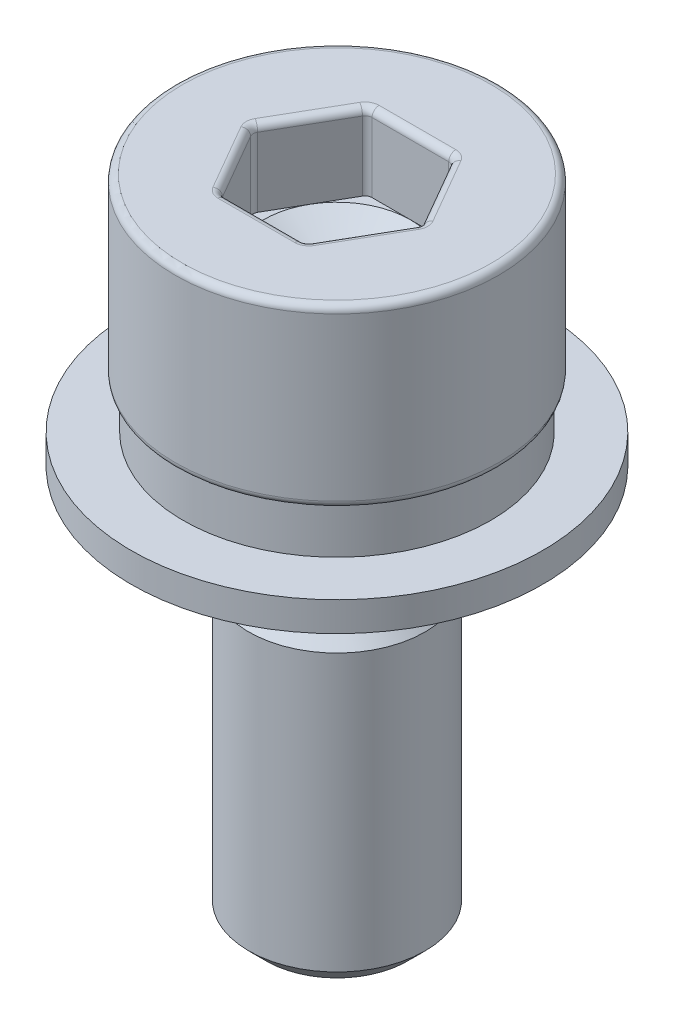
ISO-10303-21;
HEADER;
FILE_DESCRIPTION(('STEP AP214'),'2;1');
FILE_NAME('part.step','',(''),(''),'','','');
FILE_SCHEMA(('AUTOMOTIVE_DESIGN { 1 0 10303 214 1 1 1 1 }'));
ENDSEC;
DATA;
#1=APPLICATION_CONTEXT('core data for automotive mechanical design processes');
#2=APPLICATION_PROTOCOL_DEFINITION('international standard','automotive_design',2000,#1);
#3=PRODUCT_CONTEXT('',#1,'mechanical');
#4=PRODUCT('Part','Part','',(#3));
#5=PRODUCT_RELATED_PRODUCT_CATEGORY('part','',(#4));
#6=PRODUCT_DEFINITION_FORMATION('','',#4);
#7=PRODUCT_DEFINITION_CONTEXT('part definition',#1,'design');
#8=PRODUCT_DEFINITION('design','',#6,#7);
#9=PRODUCT_DEFINITION_SHAPE('','',#8);
#10=(LENGTH_UNIT() NAMED_UNIT(*) SI_UNIT(.MILLI.,.METRE.));
#11=(NAMED_UNIT(*) PLANE_ANGLE_UNIT() SI_UNIT($,.RADIAN.));
#12=(NAMED_UNIT(*) SI_UNIT($,.STERADIAN.) SOLID_ANGLE_UNIT());
#13=UNCERTAINTY_MEASURE_WITH_UNIT(LENGTH_MEASURE(1.E-05),#10,'distance_accuracy_value','');
#14=(GEOMETRIC_REPRESENTATION_CONTEXT(3) GLOBAL_UNCERTAINTY_ASSIGNED_CONTEXT((#13)) GLOBAL_UNIT_ASSIGNED_CONTEXT((#10,
#11,#12)) REPRESENTATION_CONTEXT('',''));
#15=CARTESIAN_POINT('',(0.,0.,0.));
#16=DIRECTION('',(0.,0.,1.));
#17=DIRECTION('',(1.,0.,0.));
#18=AXIS2_PLACEMENT_3D('',#15,#16,#17);
#19=CARTESIAN_POINT('',(0.,-1.30000000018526,0.));
#20=DIRECTION('',(0.,1.,0.));
#21=DIRECTION('',(-1.,0.,0.));
#22=AXIS2_PLACEMENT_3D('',#19,#20,#21);
#23=CONICAL_SURFACE('',#22,1.24999999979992,1.09083078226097);
#24=CARTESIAN_POINT('',(2.55795384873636E-10,-1.9507088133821,0.));
#25=VERTEX_POINT('',#24);
#26=VERTEX_LOOP('',#25);
#27=FACE_BOUND('',#26,.T.);
#28=CARTESIAN_POINT('',(0.,-1.3000000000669,0.));
#29=DIRECTION('',(0.,1.,0.));
#30=DIRECTION('',(-1.,0.,0.));
#31=AXIS2_PLACEMENT_3D('',#28,#29,#30);
#32=CIRCLE('',#31,1.25000000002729);
#33=CARTESIAN_POINT('',(1.08253175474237,-1.30000000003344,-0.625000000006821));
#34=VERTEX_POINT('',#33);
#35=CARTESIAN_POINT('',(1.08253175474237,-1.30000000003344,0.625000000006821));
#36=VERTEX_POINT('',#35);
#37=EDGE_CURVE('E149',#34,#36,#32,.F.);
#38=ORIENTED_EDGE('',*,*,#37,.F.);
#39=CARTESIAN_POINT('',(0.,-1.3000000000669,0.));
#40=DIRECTION('',(0.,1.,0.));
#41=DIRECTION('',(-1.,0.,0.));
#42=AXIS2_PLACEMENT_3D('',#39,#40,#41);
#43=CIRCLE('',#42,1.25000000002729);
#44=CARTESIAN_POINT('',(0.,-1.30000000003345,-1.25000000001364));
#45=VERTEX_POINT('',#44);
#46=EDGE_CURVE('E20',#45,#34,#43,.F.);
#47=ORIENTED_EDGE('',*,*,#46,.F.);
#48=CARTESIAN_POINT('',(0.,-1.3000000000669,0.));
#49=DIRECTION('',(0.,1.,0.));
#50=DIRECTION('',(-1.,0.,0.));
#51=AXIS2_PLACEMENT_3D('',#48,#49,#50);
#52=CIRCLE('',#51,1.25000000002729);
#53=CARTESIAN_POINT('',(-1.08253175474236,-1.30000000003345,-0.625000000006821));
#54=VERTEX_POINT('',#53);
#55=EDGE_CURVE('E278',#54,#45,#52,.F.);
#56=ORIENTED_EDGE('',*,*,#55,.F.);
#57=CARTESIAN_POINT('',(0.,-1.3000000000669,0.));
#58=DIRECTION('',(0.,1.,0.));
#59=DIRECTION('',(-1.,0.,0.));
#60=AXIS2_PLACEMENT_3D('',#57,#58,#59);
#61=CIRCLE('',#60,1.25000000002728);
#62=CARTESIAN_POINT('',(-1.08253175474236,-1.30000000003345,0.625000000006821));
#63=VERTEX_POINT('',#62);
#64=EDGE_CURVE('E275',#63,#54,#61,.F.);
#65=ORIENTED_EDGE('',*,*,#64,.F.);
#66=CARTESIAN_POINT('',(0.,-1.3000000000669,0.));
#67=DIRECTION('',(0.,1.,0.));
#68=DIRECTION('',(-1.,0.,0.));
#69=AXIS2_PLACEMENT_3D('',#66,#67,#68);
#70=CIRCLE('',#69,1.25000000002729);
#71=CARTESIAN_POINT('',(0.,-1.30000000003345,1.25000000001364));
#72=VERTEX_POINT('',#71);
#73=EDGE_CURVE('E280',#72,#63,#70,.F.);
#74=ORIENTED_EDGE('',*,*,#73,.F.);
#75=CARTESIAN_POINT('',(0.,-1.3000000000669,0.));
#76=DIRECTION('',(0.,1.,0.));
#77=DIRECTION('',(-1.,0.,0.));
#78=AXIS2_PLACEMENT_3D('',#75,#76,#77);
#79=CIRCLE('',#78,1.25000000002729);
#80=EDGE_CURVE('E154',#36,#72,#79,.F.);
#81=ORIENTED_EDGE('',*,*,#80,.F.);
#82=EDGE_LOOP('',(#38,#47,#56,#65,#74,#81));
#83=FACE_BOUND('',#82,.T.);
#84=ADVANCED_FACE('F16',(#27,#83),#23,.F.);
#85=CARTESIAN_POINT('',(0.,-1.3,0.));
#86=DIRECTION('',(0.,1.,0.));
#87=DIRECTION('',(-1.,0.,0.));
#88=AXIS2_PLACEMENT_3D('',#85,#86,#87);
#89=PLANE('',#88);
#90=DIRECTION('',(-0.5,0.,-0.866025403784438));
#91=VECTOR('',#90,1.);
#92=CARTESIAN_POINT('',(1.44337567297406,-1.30000000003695,0.));
#93=LINE('',#92,#91);
#94=CARTESIAN_POINT('',(0.756328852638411,-1.30000000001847,-1.19));
#95=VERTEX_POINT('',#94);
#96=EDGE_CURVE('E167',#34,#95,#93,.T.);
#97=ORIENTED_EDGE('',*,*,#96,.T.);
#98=CARTESIAN_POINT('',(0.652405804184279,-1.3,-1.13));
#99=DIRECTION('',(0.,-1.,0.));
#100=DIRECTION('',(1.,0.,0.));
#101=AXIS2_PLACEMENT_3D('',#98,#99,#100);
#102=CIRCLE('',#101,0.12);
#103=CARTESIAN_POINT('',(0.652405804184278,-1.3,-1.25));
#104=VERTEX_POINT('',#103);
#105=EDGE_CURVE('E272',#95,#104,#102,.F.);
#106=ORIENTED_EDGE('',*,*,#105,.T.);
#107=DIRECTION('',(-1.,0.,0.));
#108=VECTOR('',#107,1.);
#109=CARTESIAN_POINT('',(0.721687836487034,-1.3,-1.25));
#110=LINE('',#109,#108);
#111=EDGE_CURVE('E174',#104,#45,#110,.T.);
#112=ORIENTED_EDGE('',*,*,#111,.T.);
#113=ORIENTED_EDGE('',*,*,#46,.T.);
#114=EDGE_LOOP('',(#97,#106,#112,#113));
#115=FACE_BOUND('',#114,.T.);
#116=ADVANCED_FACE('F171',(#115),#89,.T.);
#117=CARTESIAN_POINT('',(0.,-1.3,0.));
#118=DIRECTION('',(0.,1.,0.));
#119=DIRECTION('',(-1.,0.,0.));
#120=AXIS2_PLACEMENT_3D('',#117,#118,#119);
#121=PLANE('',#120);
#122=CARTESIAN_POINT('',(1.30481160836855,-1.3,0.));
#123=DIRECTION('',(0.,-1.,0.));
#124=DIRECTION('',(1.,0.,0.));
#125=AXIS2_PLACEMENT_3D('',#122,#123,#124);
#126=CIRCLE('',#125,0.12);
#127=CARTESIAN_POINT('',(1.40873465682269,-1.30000000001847,0.06));
#128=VERTEX_POINT('',#127);
#129=CARTESIAN_POINT('',(1.40873465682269,-1.3,-0.06));
#130=VERTEX_POINT('',#129);
#131=EDGE_CURVE('E162',#128,#130,#126,.F.);
#132=ORIENTED_EDGE('',*,*,#131,.T.);
#133=DIRECTION('',(-0.5,0.,-0.866025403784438));
#134=VECTOR('',#133,1.);
#135=CARTESIAN_POINT('',(1.44337567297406,-1.3,0.));
#136=LINE('',#135,#134);
#137=EDGE_CURVE('E159',#130,#34,#136,.T.);
#138=ORIENTED_EDGE('',*,*,#137,.T.);
#139=ORIENTED_EDGE('',*,*,#37,.T.);
#140=DIRECTION('',(0.5,0.,-0.866025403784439));
#141=VECTOR('',#140,1.);
#142=CARTESIAN_POINT('',(0.721687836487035,-1.30000000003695,1.25));
#143=LINE('',#142,#141);
#144=EDGE_CURVE('E304',#36,#128,#143,.T.);
#145=ORIENTED_EDGE('',*,*,#144,.T.);
#146=EDGE_LOOP('',(#132,#138,#139,#145));
#147=FACE_BOUND('',#146,.T.);
#148=ADVANCED_FACE('F160',(#147),#121,.T.);
#149=CARTESIAN_POINT('',(0.,-1.3,0.));
#150=DIRECTION('',(0.,1.,0.));
#151=DIRECTION('',(-1.,0.,0.));
#152=AXIS2_PLACEMENT_3D('',#149,#150,#151);
#153=PLANE('',#152);
#154=DIRECTION('',(1.,0.,0.));
#155=VECTOR('',#154,1.);
#156=CARTESIAN_POINT('',(-0.721687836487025,-1.30000000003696,1.25));
#157=LINE('',#156,#155);
#158=CARTESIAN_POINT('',(0.65240580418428,-1.30000000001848,1.25));
#159=VERTEX_POINT('',#158);
#160=EDGE_CURVE('E286',#72,#159,#157,.T.);
#161=ORIENTED_EDGE('',*,*,#160,.T.);
#162=CARTESIAN_POINT('',(0.65240580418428,-1.3,1.13));
#163=DIRECTION('',(0.,-1.,0.));
#164=DIRECTION('',(1.,0.,0.));
#165=AXIS2_PLACEMENT_3D('',#162,#163,#164);
#166=CIRCLE('',#165,0.12);
#167=CARTESIAN_POINT('',(0.756328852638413,-1.3,1.19));
#168=VERTEX_POINT('',#167);
#169=EDGE_CURVE('E266',#159,#168,#166,.F.);
#170=ORIENTED_EDGE('',*,*,#169,.T.);
#171=DIRECTION('',(0.5,0.,-0.866025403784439));
#172=VECTOR('',#171,1.);
#173=CARTESIAN_POINT('',(0.721687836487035,-1.3,1.25));
#174=LINE('',#173,#172);
#175=EDGE_CURVE('E271',#168,#36,#174,.T.);
#176=ORIENTED_EDGE('',*,*,#175,.T.);
#177=ORIENTED_EDGE('',*,*,#80,.T.);
#178=EDGE_LOOP('',(#161,#170,#176,#177));
#179=FACE_BOUND('',#178,.T.);
#180=ADVANCED_FACE('F285',(#179),#153,.T.);
#181=CARTESIAN_POINT('',(0.,-1.3,0.));
#182=DIRECTION('',(0.,1.,0.));
#183=DIRECTION('',(-1.,0.,0.));
#184=AXIS2_PLACEMENT_3D('',#181,#182,#183);
#185=PLANE('',#184);
#186=DIRECTION('',(0.5,0.,0.866025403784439));
#187=VECTOR('',#186,1.);
#188=CARTESIAN_POINT('',(-1.44337567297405,-1.30000000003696,0.));
#189=LINE('',#188,#187);
#190=CARTESIAN_POINT('',(-0.756328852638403,-1.30000000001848,1.19));
#191=VERTEX_POINT('',#190);
#192=EDGE_CURVE('E364',#63,#191,#189,.T.);
#193=ORIENTED_EDGE('',*,*,#192,.T.);
#194=CARTESIAN_POINT('',(-0.65240580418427,-1.3,1.13));
#195=DIRECTION('',(0.,-1.,0.));
#196=DIRECTION('',(1.,0.,0.));
#197=AXIS2_PLACEMENT_3D('',#194,#195,#196);
#198=CIRCLE('',#197,0.12);
#199=CARTESIAN_POINT('',(-0.65240580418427,-1.3,1.25));
#200=VERTEX_POINT('',#199);
#201=EDGE_CURVE('E262',#191,#200,#198,.F.);
#202=ORIENTED_EDGE('',*,*,#201,.T.);
#203=DIRECTION('',(1.,0.,0.));
#204=VECTOR('',#203,1.);
#205=CARTESIAN_POINT('',(-0.721687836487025,-1.3,1.25));
#206=LINE('',#205,#204);
#207=EDGE_CURVE('E296',#200,#72,#206,.T.);
#208=ORIENTED_EDGE('',*,*,#207,.T.);
#209=ORIENTED_EDGE('',*,*,#73,.T.);
#210=EDGE_LOOP('',(#193,#202,#208,#209));
#211=FACE_BOUND('',#210,.T.);
#212=ADVANCED_FACE('F705',(#211),#185,.T.);
#213=CARTESIAN_POINT('',(0.,-1.3,0.));
#214=DIRECTION('',(0.,1.,0.));
#215=DIRECTION('',(-1.,0.,0.));
#216=AXIS2_PLACEMENT_3D('',#213,#214,#215);
#217=PLANE('',#216);
#218=DIRECTION('',(-1.,0.,0.));
#219=VECTOR('',#218,1.);
#220=CARTESIAN_POINT('',(0.721687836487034,-1.30000000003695,-1.25));
#221=LINE('',#220,#219);
#222=CARTESIAN_POINT('',(-0.65240580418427,-1.30000000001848,-1.25));
#223=VERTEX_POINT('',#222);
#224=EDGE_CURVE('E187',#45,#223,#221,.T.);
#225=ORIENTED_EDGE('',*,*,#224,.T.);
#226=CARTESIAN_POINT('',(-0.65240580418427,-1.3,-1.13));
#227=DIRECTION('',(0.,-1.,0.));
#228=DIRECTION('',(1.,0.,0.));
#229=AXIS2_PLACEMENT_3D('',#226,#227,#228);
#230=CIRCLE('',#229,0.12);
#231=CARTESIAN_POINT('',(-0.756328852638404,-1.3,-1.19));
#232=VERTEX_POINT('',#231);
#233=EDGE_CURVE('E188',#223,#232,#230,.F.);
#234=ORIENTED_EDGE('',*,*,#233,.T.);
#235=DIRECTION('',(-0.5,0.,0.866025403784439));
#236=VECTOR('',#235,1.);
#237=CARTESIAN_POINT('',(-0.721687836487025,-1.3,-1.25));
#238=LINE('',#237,#236);
#239=EDGE_CURVE('E358',#232,#54,#238,.T.);
#240=ORIENTED_EDGE('',*,*,#239,.T.);
#241=ORIENTED_EDGE('',*,*,#55,.T.);
#242=EDGE_LOOP('',(#225,#234,#240,#241));
#243=FACE_BOUND('',#242,.T.);
#244=ADVANCED_FACE('F701',(#243),#217,.T.);
#245=CARTESIAN_POINT('',(0.,-1.3,0.));
#246=DIRECTION('',(0.,1.,0.));
#247=DIRECTION('',(-1.,0.,0.));
#248=AXIS2_PLACEMENT_3D('',#245,#246,#247);
#249=PLANE('',#248);
#250=DIRECTION('',(-0.5,0.,0.866025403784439));
#251=VECTOR('',#250,1.);
#252=CARTESIAN_POINT('',(-0.721687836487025,-1.30000000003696,-1.25));
#253=LINE('',#252,#251);
#254=CARTESIAN_POINT('',(-1.40873465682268,-1.30000000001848,-0.06));
#255=VERTEX_POINT('',#254);
#256=EDGE_CURVE('E355',#54,#255,#253,.T.);
#257=ORIENTED_EDGE('',*,*,#256,.T.);
#258=CARTESIAN_POINT('',(-1.30481160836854,-1.3,0.));
#259=DIRECTION('',(0.,-1.,0.));
#260=DIRECTION('',(1.,0.,0.));
#261=AXIS2_PLACEMENT_3D('',#258,#259,#260);
#262=CIRCLE('',#261,0.12);
#263=CARTESIAN_POINT('',(-1.40873465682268,-1.3,0.06));
#264=VERTEX_POINT('',#263);
#265=EDGE_CURVE('E258',#255,#264,#262,.F.);
#266=ORIENTED_EDGE('',*,*,#265,.T.);
#267=DIRECTION('',(0.5,0.,0.866025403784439));
#268=VECTOR('',#267,1.);
#269=CARTESIAN_POINT('',(-1.44337567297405,-1.3,0.));
#270=LINE('',#269,#268);
#271=EDGE_CURVE('E362',#264,#63,#270,.T.);
#272=ORIENTED_EDGE('',*,*,#271,.T.);
#273=ORIENTED_EDGE('',*,*,#64,.T.);
#274=EDGE_LOOP('',(#257,#266,#272,#273));
#275=FACE_BOUND('',#274,.T.);
#276=ADVANCED_FACE('F697',(#275),#249,.T.);
#277=CARTESIAN_POINT('',(-0.65240580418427,-1.3,-1.13));
#278=DIRECTION('',(0.,-1.,0.));
#279=DIRECTION('',(1.,0.,0.));
#280=AXIS2_PLACEMENT_3D('',#277,#278,#279);
#281=CYLINDRICAL_SURFACE('',#280,0.12);
#282=CARTESIAN_POINT('',(-0.652405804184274,-0.120000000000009,-1.13));
#283=DIRECTION('',(0.,-1.,0.));
#284=DIRECTION('',(1.,0.,0.));
#285=AXIS2_PLACEMENT_3D('',#282,#283,#284);
#286=CIRCLE('',#285,0.12);
#287=CARTESIAN_POINT('',(-0.756328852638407,-0.12000000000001,-1.19));
#288=VERTEX_POINT('',#287);
#289=CARTESIAN_POINT('',(-0.652405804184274,-0.120000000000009,-1.25));
#290=VERTEX_POINT('',#289);
#291=EDGE_CURVE('E437',#288,#290,#286,.T.);
#292=ORIENTED_EDGE('',*,*,#291,.F.);
#293=DIRECTION('',(0.,1.,0.));
#294=VECTOR('',#293,1.);
#295=CARTESIAN_POINT('',(-0.756328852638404,-1.3,-1.19));
#296=LINE('',#295,#294);
#297=EDGE_CURVE('E361',#288,#232,#296,.F.);
#298=ORIENTED_EDGE('',*,*,#297,.T.);
#299=ORIENTED_EDGE('',*,*,#233,.F.);
#300=DIRECTION('',(0.,1.,0.));
#301=VECTOR('',#300,1.);
#302=CARTESIAN_POINT('',(-0.65240580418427,-1.3,-1.25));
#303=LINE('',#302,#301);
#304=EDGE_CURVE('E189',#223,#290,#303,.T.);
#305=ORIENTED_EDGE('',*,*,#304,.T.);
#306=EDGE_LOOP('',(#292,#298,#299,#305));
#307=FACE_BOUND('',#306,.T.);
#308=ADVANCED_FACE('F693',(#307),#281,.F.);
#309=CARTESIAN_POINT('',(0.721687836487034,-1.3,-1.25));
#310=DIRECTION('',(0.,0.,-1.));
#311=DIRECTION('',(-1.,0.,0.));
#312=AXIS2_PLACEMENT_3D('',#309,#310,#311);
#313=PLANE('',#312);
#314=ORIENTED_EDGE('',*,*,#224,.F.);
#315=ORIENTED_EDGE('',*,*,#111,.F.);
#316=DIRECTION('',(0.,-1.,0.));
#317=VECTOR('',#316,1.);
#318=CARTESIAN_POINT('',(0.652405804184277,-1.3,-1.25));
#319=LINE('',#318,#317);
#320=CARTESIAN_POINT('',(0.652405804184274,-0.120000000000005,-1.25));
#321=VERTEX_POINT('',#320);
#322=EDGE_CURVE('E168',#104,#321,#319,.F.);
#323=ORIENTED_EDGE('',*,*,#322,.T.);
#324=DIRECTION('',(1.,0.,0.));
#325=VECTOR('',#324,1.);
#326=CARTESIAN_POINT('',(0.72168783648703,-0.120000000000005,-1.25));
#327=LINE('',#326,#325);
#328=EDGE_CURVE('E345',#290,#321,#327,.T.);
#329=ORIENTED_EDGE('',*,*,#328,.F.);
#330=ORIENTED_EDGE('',*,*,#304,.F.);
#331=EDGE_LOOP('',(#314,#315,#323,#329,#330));
#332=FACE_BOUND('',#331,.T.);
#333=ADVANCED_FACE('F689',(#332),#313,.F.);
#334=CARTESIAN_POINT('',(0.652405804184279,-1.3,-1.13));
#335=DIRECTION('',(0.,-1.,0.));
#336=DIRECTION('',(1.,0.,0.));
#337=AXIS2_PLACEMENT_3D('',#334,#335,#336);
#338=CYLINDRICAL_SURFACE('',#337,0.12);
#339=CARTESIAN_POINT('',(0.652405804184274,-0.120000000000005,-1.13));
#340=DIRECTION('',(0.,-1.,0.));
#341=DIRECTION('',(1.,0.,0.));
#342=AXIS2_PLACEMENT_3D('',#339,#340,#341);
#343=CIRCLE('',#342,0.12);
#344=CARTESIAN_POINT('',(0.756328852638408,-0.120000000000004,-1.19));
#345=VERTEX_POINT('',#344);
#346=EDGE_CURVE('E335',#321,#345,#343,.T.);
#347=ORIENTED_EDGE('',*,*,#346,.F.);
#348=ORIENTED_EDGE('',*,*,#322,.F.);
#349=ORIENTED_EDGE('',*,*,#105,.F.);
#350=DIRECTION('',(0.,1.,0.));
#351=VECTOR('',#350,1.);
#352=CARTESIAN_POINT('',(0.756328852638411,-1.3,-1.19));
#353=LINE('',#352,#351);
#354=EDGE_CURVE('E180',#95,#345,#353,.T.);
#355=ORIENTED_EDGE('',*,*,#354,.T.);
#356=EDGE_LOOP('',(#347,#348,#349,#355));
#357=FACE_BOUND('',#356,.T.);
#358=ADVANCED_FACE('F686',(#357),#338,.F.);
#359=CARTESIAN_POINT('',(1.44337567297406,-1.3,0.));
#360=DIRECTION('',(0.866025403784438,0.,-0.5));
#361=DIRECTION('',(-0.5,0.,-0.866025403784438));
#362=AXIS2_PLACEMENT_3D('',#359,#360,#361);
#363=PLANE('',#362);
#364=DIRECTION('',(0.5,0.,0.866025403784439));
#365=VECTOR('',#364,1.);
#366=CARTESIAN_POINT('',(1.44337567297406,-0.120000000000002,0.));
#367=LINE('',#366,#365);
#368=CARTESIAN_POINT('',(1.40873465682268,-0.120000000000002,-0.06));
#369=VERTEX_POINT('',#368);
#370=EDGE_CURVE('E327',#345,#369,#367,.T.);
#371=ORIENTED_EDGE('',*,*,#370,.F.);
#372=ORIENTED_EDGE('',*,*,#354,.F.);
#373=ORIENTED_EDGE('',*,*,#96,.F.);
#374=ORIENTED_EDGE('',*,*,#137,.F.);
#375=DIRECTION('',(0.,-1.,0.));
#376=VECTOR('',#375,1.);
#377=CARTESIAN_POINT('',(1.40873465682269,-1.3,-0.06));
#378=LINE('',#377,#376);
#379=EDGE_CURVE('E182',#130,#369,#378,.F.);
#380=ORIENTED_EDGE('',*,*,#379,.T.);
#381=EDGE_LOOP('',(#371,#372,#373,#374,#380));
#382=FACE_BOUND('',#381,.T.);
#383=ADVANCED_FACE('F178',(#382),#363,.F.);
#384=CARTESIAN_POINT('',(1.30481160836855,-1.3,0.));
#385=DIRECTION('',(0.,-1.,0.));
#386=DIRECTION('',(1.,0.,0.));
#387=AXIS2_PLACEMENT_3D('',#384,#385,#386);
#388=CYLINDRICAL_SURFACE('',#387,0.12);
#389=CARTESIAN_POINT('',(1.30481160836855,-0.120000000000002,0.));
#390=DIRECTION('',(0.,-1.,0.));
#391=DIRECTION('',(1.,0.,0.));
#392=AXIS2_PLACEMENT_3D('',#389,#390,#391);
#393=CIRCLE('',#392,0.12);
#394=CARTESIAN_POINT('',(1.40873465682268,-0.120000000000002,0.0599999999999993));
#395=VERTEX_POINT('',#394);
#396=EDGE_CURVE('E318',#369,#395,#393,.T.);
#397=ORIENTED_EDGE('',*,*,#396,.F.);
#398=ORIENTED_EDGE('',*,*,#379,.F.);
#399=ORIENTED_EDGE('',*,*,#131,.F.);
#400=DIRECTION('',(0.,1.,0.));
#401=VECTOR('',#400,1.);
#402=CARTESIAN_POINT('',(1.40873465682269,-1.3,0.06));
#403=LINE('',#402,#401);
#404=EDGE_CURVE('E269',#128,#395,#403,.T.);
#405=ORIENTED_EDGE('',*,*,#404,.T.);
#406=EDGE_LOOP('',(#397,#398,#399,#405));
#407=FACE_BOUND('',#406,.T.);
#408=ADVANCED_FACE('F680',(#407),#388,.F.);
#409=CARTESIAN_POINT('',(0.721687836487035,-1.3,1.25));
#410=DIRECTION('',(0.866025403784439,0.,0.5));
#411=DIRECTION('',(0.5,0.,-0.866025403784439));
#412=AXIS2_PLACEMENT_3D('',#409,#410,#411);
#413=PLANE('',#412);
#414=DIRECTION('',(-0.5,0.,0.866025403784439));
#415=VECTOR('',#414,1.);
#416=CARTESIAN_POINT('',(0.721687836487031,-0.120000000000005,1.25));
#417=LINE('',#416,#415);
#418=CARTESIAN_POINT('',(0.756328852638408,-0.120000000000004,1.19));
#419=VERTEX_POINT('',#418);
#420=EDGE_CURVE('E407',#395,#419,#417,.T.);
#421=ORIENTED_EDGE('',*,*,#420,.F.);
#422=ORIENTED_EDGE('',*,*,#404,.F.);
#423=ORIENTED_EDGE('',*,*,#144,.F.);
#424=ORIENTED_EDGE('',*,*,#175,.F.);
#425=DIRECTION('',(0.,-1.,0.));
#426=VECTOR('',#425,1.);
#427=CARTESIAN_POINT('',(0.756328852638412,-1.3,1.19));
#428=LINE('',#427,#426);
#429=EDGE_CURVE('E268',#168,#419,#428,.F.);
#430=ORIENTED_EDGE('',*,*,#429,.T.);
#431=EDGE_LOOP('',(#421,#422,#423,#424,#430));
#432=FACE_BOUND('',#431,.T.);
#433=ADVANCED_FACE('F677',(#432),#413,.F.);
#434=CARTESIAN_POINT('',(0.65240580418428,-1.3,1.13));
#435=DIRECTION('',(0.,-1.,0.));
#436=DIRECTION('',(1.,0.,0.));
#437=AXIS2_PLACEMENT_3D('',#434,#435,#436);
#438=CYLINDRICAL_SURFACE('',#437,0.12);
#439=CARTESIAN_POINT('',(0.652405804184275,-0.120000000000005,1.13));
#440=DIRECTION('',(0.,-1.,0.));
#441=DIRECTION('',(1.,0.,0.));
#442=AXIS2_PLACEMENT_3D('',#439,#440,#441);
#443=CIRCLE('',#442,0.12);
#444=CARTESIAN_POINT('',(0.652405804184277,-0.120000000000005,1.25));
#445=VERTEX_POINT('',#444);
#446=EDGE_CURVE('E398',#419,#445,#443,.T.);
#447=ORIENTED_EDGE('',*,*,#446,.F.);
#448=ORIENTED_EDGE('',*,*,#429,.F.);
#449=ORIENTED_EDGE('',*,*,#169,.F.);
#450=DIRECTION('',(0.,1.,0.));
#451=VECTOR('',#450,1.);
#452=CARTESIAN_POINT('',(0.65240580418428,-1.3,1.25));
#453=LINE('',#452,#451);
#454=EDGE_CURVE('E265',#159,#445,#453,.T.);
#455=ORIENTED_EDGE('',*,*,#454,.T.);
#456=EDGE_LOOP('',(#447,#448,#449,#455));
#457=FACE_BOUND('',#456,.T.);
#458=ADVANCED_FACE('F674',(#457),#438,.F.);
#459=CARTESIAN_POINT('',(-0.721687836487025,-1.3,1.25));
#460=DIRECTION('',(0.,0.,1.));
#461=DIRECTION('',(1.,0.,0.));
#462=AXIS2_PLACEMENT_3D('',#459,#460,#461);
#463=PLANE('',#462);
#464=DIRECTION('',(-1.,0.,0.));
#465=VECTOR('',#464,1.);
#466=CARTESIAN_POINT('',(-0.721687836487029,-0.12000000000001,1.25));
#467=LINE('',#466,#465);
#468=CARTESIAN_POINT('',(-0.652405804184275,-0.120000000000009,1.25));
#469=VERTEX_POINT('',#468);
#470=EDGE_CURVE('E390',#445,#469,#467,.T.);
#471=ORIENTED_EDGE('',*,*,#470,.F.);
#472=ORIENTED_EDGE('',*,*,#454,.F.);
#473=ORIENTED_EDGE('',*,*,#160,.F.);
#474=ORIENTED_EDGE('',*,*,#207,.F.);
#475=DIRECTION('',(0.,-1.,0.));
#476=VECTOR('',#475,1.);
#477=CARTESIAN_POINT('',(-0.65240580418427,-1.3,1.25));
#478=LINE('',#477,#476);
#479=EDGE_CURVE('E264',#200,#469,#478,.F.);
#480=ORIENTED_EDGE('',*,*,#479,.T.);
#481=EDGE_LOOP('',(#471,#472,#473,#474,#480));
#482=FACE_BOUND('',#481,.T.);
#483=ADVANCED_FACE('F293',(#482),#463,.F.);
#484=CARTESIAN_POINT('',(-0.65240580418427,-1.3,1.13));
#485=DIRECTION('',(0.,-1.,0.));
#486=DIRECTION('',(1.,0.,0.));
#487=AXIS2_PLACEMENT_3D('',#484,#485,#486);
#488=CYLINDRICAL_SURFACE('',#487,0.12);
#489=CARTESIAN_POINT('',(-0.652405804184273,-0.12000000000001,1.13));
#490=DIRECTION('',(0.,-1.,0.));
#491=DIRECTION('',(1.,0.,0.));
#492=AXIS2_PLACEMENT_3D('',#489,#490,#491);
#493=CIRCLE('',#492,0.12);
#494=CARTESIAN_POINT('',(-0.756328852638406,-0.12000000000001,1.19));
#495=VERTEX_POINT('',#494);
#496=EDGE_CURVE('E381',#469,#495,#493,.T.);
#497=ORIENTED_EDGE('',*,*,#496,.F.);
#498=ORIENTED_EDGE('',*,*,#479,.F.);
#499=ORIENTED_EDGE('',*,*,#201,.F.);
#500=DIRECTION('',(0.,1.,0.));
#501=VECTOR('',#500,1.);
#502=CARTESIAN_POINT('',(-0.756328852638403,-1.3,1.19));
#503=LINE('',#502,#501);
#504=EDGE_CURVE('E261',#191,#495,#503,.T.);
#505=ORIENTED_EDGE('',*,*,#504,.T.);
#506=EDGE_LOOP('',(#497,#498,#499,#505));
#507=FACE_BOUND('',#506,.T.);
#508=ADVANCED_FACE('F521',(#507),#488,.F.);
#509=CARTESIAN_POINT('',(-1.44337567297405,-1.3,0.));
#510=DIRECTION('',(-0.866025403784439,0.,0.5));
#511=DIRECTION('',(0.5,0.,0.866025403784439));
#512=AXIS2_PLACEMENT_3D('',#509,#510,#511);
#513=PLANE('',#512);
#514=DIRECTION('',(-0.5,0.,-0.866025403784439));
#515=VECTOR('',#514,1.);
#516=CARTESIAN_POINT('',(-1.44337567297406,-0.120000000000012,0.));
#517=LINE('',#516,#515);
#518=CARTESIAN_POINT('',(-1.40873465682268,-0.120000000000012,0.06));
#519=VERTEX_POINT('',#518);
#520=EDGE_CURVE('E464',#495,#519,#517,.T.);
#521=ORIENTED_EDGE('',*,*,#520,.F.);
#522=ORIENTED_EDGE('',*,*,#504,.F.);
#523=ORIENTED_EDGE('',*,*,#192,.F.);
#524=ORIENTED_EDGE('',*,*,#271,.F.);
#525=DIRECTION('',(0.,-1.,0.));
#526=VECTOR('',#525,1.);
#527=CARTESIAN_POINT('',(-1.40873465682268,-1.3,0.06));
#528=LINE('',#527,#526);
#529=EDGE_CURVE('E260',#264,#519,#528,.F.);
#530=ORIENTED_EDGE('',*,*,#529,.T.);
#531=EDGE_LOOP('',(#521,#522,#523,#524,#530));
#532=FACE_BOUND('',#531,.T.);
#533=ADVANCED_FACE('F474',(#532),#513,.F.);
#534=CARTESIAN_POINT('',(-1.30481160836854,-1.3,0.));
#535=DIRECTION('',(0.,-1.,0.));
#536=DIRECTION('',(1.,0.,0.));
#537=AXIS2_PLACEMENT_3D('',#534,#535,#536);
#538=CYLINDRICAL_SURFACE('',#537,0.12);
#539=CARTESIAN_POINT('',(-1.30481160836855,-0.120000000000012,0.));
#540=DIRECTION('',(0.,-1.,0.));
#541=DIRECTION('',(0.,0.,-1.));
#542=AXIS2_PLACEMENT_3D('',#539,#540,#541);
#543=CIRCLE('',#542,0.120000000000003);
#544=CARTESIAN_POINT('',(-1.40873465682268,-0.120000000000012,-0.06));
#545=VERTEX_POINT('',#544);
#546=EDGE_CURVE('E458',#519,#545,#543,.T.);
#547=ORIENTED_EDGE('',*,*,#546,.F.);
#548=ORIENTED_EDGE('',*,*,#529,.F.);
#549=ORIENTED_EDGE('',*,*,#265,.F.);
#550=DIRECTION('',(0.,1.,0.));
#551=VECTOR('',#550,1.);
#552=CARTESIAN_POINT('',(-1.40873465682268,-1.3,-0.06));
#553=LINE('',#552,#551);
#554=EDGE_CURVE('E357',#255,#545,#553,.T.);
#555=ORIENTED_EDGE('',*,*,#554,.T.);
#556=EDGE_LOOP('',(#547,#548,#549,#555));
#557=FACE_BOUND('',#556,.T.);
#558=ADVANCED_FACE('F664',(#557),#538,.F.);
#559=CARTESIAN_POINT('',(-0.721687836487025,-1.3,-1.25));
#560=DIRECTION('',(-0.866025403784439,0.,-0.5));
#561=DIRECTION('',(-0.5,0.,0.866025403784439));
#562=AXIS2_PLACEMENT_3D('',#559,#560,#561);
#563=PLANE('',#562);
#564=ORIENTED_EDGE('',*,*,#256,.F.);
#565=ORIENTED_EDGE('',*,*,#239,.F.);
#566=ORIENTED_EDGE('',*,*,#297,.F.);
#567=DIRECTION('',(0.5,0.,-0.866025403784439));
#568=VECTOR('',#567,1.);
#569=CARTESIAN_POINT('',(-0.72168783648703,-0.120000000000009,-1.25));
#570=LINE('',#569,#568);
#571=EDGE_CURVE('E444',#545,#288,#570,.T.);
#572=ORIENTED_EDGE('',*,*,#571,.F.);
#573=ORIENTED_EDGE('',*,*,#554,.F.);
#574=EDGE_LOOP('',(#564,#565,#566,#572,#573));
#575=FACE_BOUND('',#574,.T.);
#576=ADVANCED_FACE('F660',(#575),#563,.F.);
#577=CARTESIAN_POINT('',(1.5,-11.,0.));
#578=DIRECTION('',(0.,-1.,0.));
#579=DIRECTION('',(1.,0.,0.));
#580=AXIS2_PLACEMENT_3D('',#577,#578,#579);
#581=PLANE('',#580);
#582=CARTESIAN_POINT('',(0.,-10.9999999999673,0.));
#583=DIRECTION('',(0.,1.,0.));
#584=DIRECTION('',(-1.,0.,0.));
#585=AXIS2_PLACEMENT_3D('',#582,#583,#584);
#586=CIRCLE('',#585,1.20000000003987);
#587=CARTESIAN_POINT('',(-1.20000000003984,-10.9999999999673,0.));
#588=VERTEX_POINT('',#587);
#589=EDGE_CURVE('E254',#588,#588,#586,.T.);
#590=ORIENTED_EDGE('',*,*,#589,.F.);
#591=EDGE_LOOP('',(#590));
#592=FACE_BOUND('',#591,.T.);
#593=ADVANCED_FACE('F657',(#592),#581,.T.);
#594=CARTESIAN_POINT('',(-0.652405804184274,-0.120000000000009,-1.13));
#595=DIRECTION('',(0.,1.,0.));
#596=DIRECTION('',(-1.,0.,0.));
#597=AXIS2_PLACEMENT_3D('',#594,#595,#596);
#598=TOROIDAL_SURFACE('',#597,0.24,0.12);
#599=CARTESIAN_POINT('',(-0.652405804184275,-0.120000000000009,-1.37));
#600=DIRECTION('',(1.,0.,0.));
#601=DIRECTION('',(0.,1.,0.));
#602=AXIS2_PLACEMENT_3D('',#599,#600,#601);
#603=CIRCLE('',#602,0.12);
#604=CARTESIAN_POINT('',(-0.652405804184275,0.,-1.37));
#605=VERTEX_POINT('',#604);
#606=EDGE_CURVE('E348',#605,#290,#603,.T.);
#607=ORIENTED_EDGE('',*,*,#606,.F.);
#608=CARTESIAN_POINT('',(-0.652405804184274,0.,-1.13));
#609=DIRECTION('',(0.,1.,0.));
#610=DIRECTION('',(-1.,0.,0.));
#611=AXIS2_PLACEMENT_3D('',#608,#609,#610);
#612=CIRCLE('',#611,0.24);
#613=CARTESIAN_POINT('',(-0.86025190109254,0.,-1.25));
#614=VERTEX_POINT('',#613);
#615=EDGE_CURVE('E251',#614,#605,#612,.F.);
#616=ORIENTED_EDGE('',*,*,#615,.F.);
#617=CARTESIAN_POINT('',(-0.86025190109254,-0.12000000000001,-1.25));
#618=DIRECTION('',(0.5,0.,-0.866025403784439));
#619=DIRECTION('',(-0.866025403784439,0.,-0.5));
#620=AXIS2_PLACEMENT_3D('',#617,#618,#619);
#621=CIRCLE('',#620,0.12);
#622=EDGE_CURVE('E257',#288,#614,#621,.F.);
#623=ORIENTED_EDGE('',*,*,#622,.F.);
#624=ORIENTED_EDGE('',*,*,#291,.T.);
#625=EDGE_LOOP('',(#607,#616,#623,#624));
#626=FACE_BOUND('',#625,.T.);
#627=ADVANCED_FACE('F655',(#626),#598,.T.);
#628=CARTESIAN_POINT('',(0.72168783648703,-0.120000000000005,-1.37));
#629=DIRECTION('',(1.,0.,0.));
#630=DIRECTION('',(0.,1.,0.));
#631=AXIS2_PLACEMENT_3D('',#628,#629,#630);
#632=CYLINDRICAL_SURFACE('',#631,0.12);
#633=CARTESIAN_POINT('',(0.652405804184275,-0.120000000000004,-1.37));
#634=DIRECTION('',(1.,0.,0.));
#635=DIRECTION('',(0.,1.,0.));
#636=AXIS2_PLACEMENT_3D('',#633,#634,#635);
#637=CIRCLE('',#636,0.12);
#638=CARTESIAN_POINT('',(0.652405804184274,0.,-1.37));
#639=VERTEX_POINT('',#638);
#640=EDGE_CURVE('E338',#639,#321,#637,.T.);
#641=ORIENTED_EDGE('',*,*,#640,.F.);
#642=DIRECTION('',(-1.,0.,0.));
#643=VECTOR('',#642,1.);
#644=CARTESIAN_POINT('',(1.25,0.,-1.37));
#645=LINE('',#644,#643);
#646=EDGE_CURVE('E250',#605,#639,#645,.F.);
#647=ORIENTED_EDGE('',*,*,#646,.F.);
#648=ORIENTED_EDGE('',*,*,#606,.T.);
#649=ORIENTED_EDGE('',*,*,#328,.T.);
#650=EDGE_LOOP('',(#641,#647,#648,#649));
#651=FACE_BOUND('',#650,.T.);
#652=ADVANCED_FACE('F652',(#651),#632,.T.);
#653=CARTESIAN_POINT('',(0.652405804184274,-0.120000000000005,-1.13));
#654=DIRECTION('',(0.,1.,0.));
#655=DIRECTION('',(-1.,0.,0.));
#656=AXIS2_PLACEMENT_3D('',#653,#654,#655);
#657=TOROIDAL_SURFACE('',#656,0.24,0.12);
#658=ORIENTED_EDGE('',*,*,#640,.T.);
#659=ORIENTED_EDGE('',*,*,#346,.T.);
#660=CARTESIAN_POINT('',(0.86025190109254,-0.120000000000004,-1.25));
#661=DIRECTION('',(0.5,0.,0.866025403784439));
#662=DIRECTION('',(0.866025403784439,0.,-0.5));
#663=AXIS2_PLACEMENT_3D('',#660,#661,#662);
#664=CIRCLE('',#663,0.12);
#665=CARTESIAN_POINT('',(0.86025190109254,0.,-1.25));
#666=VERTEX_POINT('',#665);
#667=EDGE_CURVE('E330',#666,#345,#664,.T.);
#668=ORIENTED_EDGE('',*,*,#667,.F.);
#669=CARTESIAN_POINT('',(0.652405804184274,0.,-1.13));
#670=DIRECTION('',(0.,1.,0.));
#671=DIRECTION('',(-1.,0.,0.));
#672=AXIS2_PLACEMENT_3D('',#669,#670,#671);
#673=CIRCLE('',#672,0.24);
#674=EDGE_CURVE('E247',#639,#666,#673,.F.);
#675=ORIENTED_EDGE('',*,*,#674,.F.);
#676=EDGE_LOOP('',(#658,#659,#668,#675));
#677=FACE_BOUND('',#676,.T.);
#678=ADVANCED_FACE('F650',(#677),#657,.T.);
#679=CARTESIAN_POINT('',(1.5472987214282,-0.120000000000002,-0.06));
#680=DIRECTION('',(0.5,0.,0.866025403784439));
#681=DIRECTION('',(0.866025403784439,0.,-0.5));
#682=AXIS2_PLACEMENT_3D('',#679,#680,#681);
#683=CYLINDRICAL_SURFACE('',#682,0.12);
#684=ORIENTED_EDGE('',*,*,#667,.T.);
#685=ORIENTED_EDGE('',*,*,#370,.T.);
#686=CARTESIAN_POINT('',(1.51265770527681,-0.120000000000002,-0.12));
#687=DIRECTION('',(0.5,0.,0.866025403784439));
#688=DIRECTION('',(0.866025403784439,0.,-0.5));
#689=AXIS2_PLACEMENT_3D('',#686,#687,#688);
#690=CIRCLE('',#689,0.12);
#691=CARTESIAN_POINT('',(1.51265770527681,0.,-0.12));
#692=VERTEX_POINT('',#691);
#693=EDGE_CURVE('E321',#692,#369,#690,.T.);
#694=ORIENTED_EDGE('',*,*,#693,.F.);
#695=DIRECTION('',(0.5,0.,0.866025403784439));
#696=VECTOR('',#695,1.);
#697=CARTESIAN_POINT('',(0.86025190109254,0.,-1.25));
#698=LINE('',#697,#696);
#699=EDGE_CURVE('E246',#666,#692,#698,.T.);
#700=ORIENTED_EDGE('',*,*,#699,.F.);
#701=EDGE_LOOP('',(#684,#685,#694,#700));
#702=FACE_BOUND('',#701,.T.);
#703=ADVANCED_FACE('F647',(#702),#683,.T.);
#704=CARTESIAN_POINT('',(1.30481160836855,-0.120000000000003,0.));
#705=DIRECTION('',(0.,1.,0.));
#706=DIRECTION('',(-1.,0.,0.));
#707=AXIS2_PLACEMENT_3D('',#704,#705,#706);
#708=TOROIDAL_SURFACE('',#707,0.24,0.12);
#709=ORIENTED_EDGE('',*,*,#693,.T.);
#710=ORIENTED_EDGE('',*,*,#396,.T.);
#711=CARTESIAN_POINT('',(1.51265770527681,-0.120000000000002,0.12));
#712=DIRECTION('',(-0.5,0.,0.866025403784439));
#713=DIRECTION('',(0.866025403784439,0.,0.5));
#714=AXIS2_PLACEMENT_3D('',#711,#712,#713);
#715=CIRCLE('',#714,0.12);
#716=CARTESIAN_POINT('',(1.51265770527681,0.,0.12));
#717=VERTEX_POINT('',#716);
#718=EDGE_CURVE('E320',#717,#395,#715,.T.);
#719=ORIENTED_EDGE('',*,*,#718,.F.);
#720=CARTESIAN_POINT('',(1.30481160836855,0.,0.));
#721=DIRECTION('',(0.,1.,0.));
#722=DIRECTION('',(-1.,0.,0.));
#723=AXIS2_PLACEMENT_3D('',#720,#721,#722);
#724=CIRCLE('',#723,0.24);
#725=EDGE_CURVE('E243',#692,#717,#724,.F.);
#726=ORIENTED_EDGE('',*,*,#725,.F.);
#727=EDGE_LOOP('',(#709,#710,#719,#726));
#728=FACE_BOUND('',#727,.T.);
#729=ADVANCED_FACE('F646',(#728),#708,.T.);
#730=CARTESIAN_POINT('',(0.825610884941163,-0.120000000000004,1.31));
#731=DIRECTION('',(-0.5,0.,0.866025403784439));
#732=DIRECTION('',(0.866025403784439,0.,0.5));
#733=AXIS2_PLACEMENT_3D('',#730,#731,#732);
#734=CYLINDRICAL_SURFACE('',#733,0.12);
#735=ORIENTED_EDGE('',*,*,#718,.T.);
#736=ORIENTED_EDGE('',*,*,#420,.T.);
#737=CARTESIAN_POINT('',(0.860251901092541,-0.120000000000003,1.25));
#738=DIRECTION('',(-0.5,0.,0.866025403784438));
#739=DIRECTION('',(0.866025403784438,0.,0.5));
#740=AXIS2_PLACEMENT_3D('',#737,#738,#739);
#741=CIRCLE('',#740,0.12);
#742=CARTESIAN_POINT('',(0.86025190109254,0.,1.25));
#743=VERTEX_POINT('',#742);
#744=EDGE_CURVE('E401',#743,#419,#741,.T.);
#745=ORIENTED_EDGE('',*,*,#744,.F.);
#746=DIRECTION('',(-0.5,0.,0.866025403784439));
#747=VECTOR('',#746,1.);
#748=CARTESIAN_POINT('',(1.51265770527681,0.,0.12));
#749=LINE('',#748,#747);
#750=EDGE_CURVE('E242',#717,#743,#749,.T.);
#751=ORIENTED_EDGE('',*,*,#750,.F.);
#752=EDGE_LOOP('',(#735,#736,#745,#751));
#753=FACE_BOUND('',#752,.T.);
#754=ADVANCED_FACE('F643',(#753),#734,.T.);
#755=CARTESIAN_POINT('',(0.652405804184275,-0.120000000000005,1.13));
#756=DIRECTION('',(0.,1.,0.));
#757=DIRECTION('',(-1.,0.,0.));
#758=AXIS2_PLACEMENT_3D('',#755,#756,#757);
#759=TOROIDAL_SURFACE('',#758,0.24,0.12);
#760=ORIENTED_EDGE('',*,*,#744,.T.);
#761=ORIENTED_EDGE('',*,*,#446,.T.);
#762=CARTESIAN_POINT('',(0.652405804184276,-0.120000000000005,1.37));
#763=DIRECTION('',(-1.,0.,0.));
#764=DIRECTION('',(0.,-1.,0.));
#765=AXIS2_PLACEMENT_3D('',#762,#763,#764);
#766=CIRCLE('',#765,0.12);
#767=CARTESIAN_POINT('',(0.652405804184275,0.,1.37));
#768=VERTEX_POINT('',#767);
#769=EDGE_CURVE('E393',#768,#445,#766,.T.);
#770=ORIENTED_EDGE('',*,*,#769,.F.);
#771=CARTESIAN_POINT('',(0.652405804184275,0.,1.13));
#772=DIRECTION('',(0.,1.,0.));
#773=DIRECTION('',(-1.,0.,0.));
#774=AXIS2_PLACEMENT_3D('',#771,#772,#773);
#775=CIRCLE('',#774,0.24);
#776=EDGE_CURVE('E239',#743,#768,#775,.F.);
#777=ORIENTED_EDGE('',*,*,#776,.F.);
#778=EDGE_LOOP('',(#760,#761,#770,#777));
#779=FACE_BOUND('',#778,.T.);
#780=ADVANCED_FACE('F516',(#779),#759,.T.);
#781=CARTESIAN_POINT('',(-0.721687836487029,-0.12000000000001,1.37));
#782=DIRECTION('',(-1.,0.,0.));
#783=DIRECTION('',(0.,-1.,0.));
#784=AXIS2_PLACEMENT_3D('',#781,#782,#783);
#785=CYLINDRICAL_SURFACE('',#784,0.12);
#786=CARTESIAN_POINT('',(-0.652405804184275,-0.120000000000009,1.37));
#787=DIRECTION('',(-1.,0.,0.));
#788=DIRECTION('',(0.,-1.,0.));
#789=AXIS2_PLACEMENT_3D('',#786,#787,#788);
#790=CIRCLE('',#789,0.12);
#791=CARTESIAN_POINT('',(-0.652405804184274,0.,1.37));
#792=VERTEX_POINT('',#791);
#793=EDGE_CURVE('E384',#792,#469,#790,.T.);
#794=ORIENTED_EDGE('',*,*,#793,.F.);
#795=DIRECTION('',(-1.,0.,0.));
#796=VECTOR('',#795,1.);
#797=CARTESIAN_POINT('',(1.25,0.,1.37));
#798=LINE('',#797,#796);
#799=EDGE_CURVE('E238',#768,#792,#798,.T.);
#800=ORIENTED_EDGE('',*,*,#799,.F.);
#801=ORIENTED_EDGE('',*,*,#769,.T.);
#802=ORIENTED_EDGE('',*,*,#470,.T.);
#803=EDGE_LOOP('',(#794,#800,#801,#802));
#804=FACE_BOUND('',#803,.T.);
#805=ADVANCED_FACE('F510',(#804),#785,.T.);
#806=CARTESIAN_POINT('',(-0.652405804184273,-0.12000000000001,1.13));
#807=DIRECTION('',(0.,1.,0.));
#808=DIRECTION('',(-1.,0.,0.));
#809=AXIS2_PLACEMENT_3D('',#806,#807,#808);
#810=TOROIDAL_SURFACE('',#809,0.24,0.12);
#811=CARTESIAN_POINT('',(-0.860251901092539,-0.12000000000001,1.25));
#812=DIRECTION('',(-0.5,0.,-0.866025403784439));
#813=DIRECTION('',(-0.866025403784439,0.,0.5));
#814=AXIS2_PLACEMENT_3D('',#811,#812,#813);
#815=CIRCLE('',#814,0.12);
#816=CARTESIAN_POINT('',(-0.86025190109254,0.,1.25));
#817=VERTEX_POINT('',#816);
#818=EDGE_CURVE('E383',#817,#495,#815,.T.);
#819=ORIENTED_EDGE('',*,*,#818,.F.);
#820=CARTESIAN_POINT('',(-0.652405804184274,0.,1.13));
#821=DIRECTION('',(0.,1.,0.));
#822=DIRECTION('',(-1.,0.,0.));
#823=AXIS2_PLACEMENT_3D('',#820,#821,#822);
#824=CIRCLE('',#823,0.24);
#825=EDGE_CURVE('E235',#792,#817,#824,.F.);
#826=ORIENTED_EDGE('',*,*,#825,.F.);
#827=ORIENTED_EDGE('',*,*,#793,.T.);
#828=ORIENTED_EDGE('',*,*,#496,.T.);
#829=EDGE_LOOP('',(#819,#826,#827,#828));
#830=FACE_BOUND('',#829,.T.);
#831=ADVANCED_FACE('F524',(#830),#810,.T.);
#832=CARTESIAN_POINT('',(-1.54729872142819,-0.120000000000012,0.06));
#833=DIRECTION('',(-0.5,0.,-0.866025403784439));
#834=DIRECTION('',(-0.866025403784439,0.,0.5));
#835=AXIS2_PLACEMENT_3D('',#832,#833,#834);
#836=CYLINDRICAL_SURFACE('',#835,0.12);
#837=CARTESIAN_POINT('',(-1.51265770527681,-0.120000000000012,0.12));
#838=DIRECTION('',(-0.5,0.,-0.866025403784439));
#839=DIRECTION('',(-0.866025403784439,0.,0.5));
#840=AXIS2_PLACEMENT_3D('',#837,#838,#839);
#841=CIRCLE('',#840,0.12);
#842=CARTESIAN_POINT('',(-1.51265770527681,0.,0.12));
#843=VERTEX_POINT('',#842);
#844=EDGE_CURVE('E461',#843,#519,#841,.T.);
#845=ORIENTED_EDGE('',*,*,#844,.F.);
#846=DIRECTION('',(-0.5,0.,-0.866025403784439));
#847=VECTOR('',#846,1.);
#848=CARTESIAN_POINT('',(-0.86025190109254,0.,1.25));
#849=LINE('',#848,#847);
#850=EDGE_CURVE('E234',#817,#843,#849,.T.);
#851=ORIENTED_EDGE('',*,*,#850,.F.);
#852=ORIENTED_EDGE('',*,*,#818,.T.);
#853=ORIENTED_EDGE('',*,*,#520,.T.);
#854=EDGE_LOOP('',(#845,#851,#852,#853));
#855=FACE_BOUND('',#854,.T.);
#856=ADVANCED_FACE('F484',(#855),#836,.T.);
#857=CARTESIAN_POINT('',(-1.30481160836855,-0.120000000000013,0.));
#858=DIRECTION('',(0.,1.,0.));
#859=DIRECTION('',(0.,0.,1.));
#860=AXIS2_PLACEMENT_3D('',#857,#858,#859);
#861=TOROIDAL_SURFACE('',#860,0.240000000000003,0.12);
#862=CARTESIAN_POINT('',(-1.51265770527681,-0.120000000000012,-0.12));
#863=DIRECTION('',(0.5,0.,-0.866025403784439));
#864=DIRECTION('',(-0.866025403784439,0.,-0.5));
#865=AXIS2_PLACEMENT_3D('',#862,#863,#864);
#866=CIRCLE('',#865,0.12);
#867=CARTESIAN_POINT('',(-1.51265770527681,0.,-0.12));
#868=VERTEX_POINT('',#867);
#869=EDGE_CURVE('E447',#868,#545,#866,.T.);
#870=ORIENTED_EDGE('',*,*,#869,.F.);
#871=CARTESIAN_POINT('',(-1.30481160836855,0.,0.));
#872=DIRECTION('',(0.,1.,0.));
#873=DIRECTION('',(0.,0.,1.));
#874=AXIS2_PLACEMENT_3D('',#871,#872,#873);
#875=CIRCLE('',#874,0.240000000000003);
#876=EDGE_CURVE('E230',#843,#868,#875,.F.);
#877=ORIENTED_EDGE('',*,*,#876,.F.);
#878=ORIENTED_EDGE('',*,*,#844,.T.);
#879=ORIENTED_EDGE('',*,*,#546,.T.);
#880=EDGE_LOOP('',(#870,#877,#878,#879));
#881=FACE_BOUND('',#880,.T.);
#882=ADVANCED_FACE('F488',(#881),#861,.T.);
#883=CARTESIAN_POINT('',(-0.825610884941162,-0.12000000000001,-1.31));
#884=DIRECTION('',(0.5,0.,-0.866025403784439));
#885=DIRECTION('',(-0.866025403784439,0.,-0.5));
#886=AXIS2_PLACEMENT_3D('',#883,#884,#885);
#887=CYLINDRICAL_SURFACE('',#886,0.12);
#888=ORIENTED_EDGE('',*,*,#622,.T.);
#889=DIRECTION('',(0.5,0.,-0.866025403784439));
#890=VECTOR('',#889,1.);
#891=CARTESIAN_POINT('',(-1.51265770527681,0.,-0.12));
#892=LINE('',#891,#890);
#893=EDGE_CURVE('E233',#868,#614,#892,.T.);
#894=ORIENTED_EDGE('',*,*,#893,.F.);
#895=ORIENTED_EDGE('',*,*,#869,.T.);
#896=ORIENTED_EDGE('',*,*,#571,.T.);
#897=EDGE_LOOP('',(#888,#894,#895,#896));
#898=FACE_BOUND('',#897,.T.);
#899=ADVANCED_FACE('F547',(#898),#887,.T.);
#900=CARTESIAN_POINT('',(0.,-10.7000000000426,0.));
#901=DIRECTION('',(0.,1.,0.));
#902=DIRECTION('',(-1.,0.,0.));
#903=AXIS2_PLACEMENT_3D('',#900,#901,#902);
#904=CONICAL_SURFACE('',#903,1.49999999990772,0.785398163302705);
#905=CARTESIAN_POINT('',(0.,-10.7,0.));
#906=DIRECTION('',(0.,-1.,0.));
#907=DIRECTION('',(1.,0.,0.));
#908=AXIS2_PLACEMENT_3D('',#905,#906,#907);
#909=CIRCLE('',#908,1.49999999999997);
#910=CARTESIAN_POINT('',(1.50000000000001,-10.7,0.));
#911=VERTEX_POINT('',#910);
#912=EDGE_CURVE('E229',#911,#911,#909,.F.);
#913=ORIENTED_EDGE('',*,*,#912,.F.);
#914=EDGE_LOOP('',(#913));
#915=FACE_BOUND('',#914,.T.);
#916=ORIENTED_EDGE('',*,*,#589,.T.);
#917=EDGE_LOOP('',(#916));
#918=FACE_BOUND('',#917,.T.);
#919=ADVANCED_FACE('F633',(#915,#918),#904,.T.);
#920=CARTESIAN_POINT('',(1.25,0.,0.));
#921=DIRECTION('',(0.,1.,0.));
#922=DIRECTION('',(-1.,0.,0.));
#923=AXIS2_PLACEMENT_3D('',#920,#921,#922);
#924=PLANE('',#923);
#925=ORIENTED_EDGE('',*,*,#876,.T.);
#926=ORIENTED_EDGE('',*,*,#893,.T.);
#927=ORIENTED_EDGE('',*,*,#615,.T.);
#928=ORIENTED_EDGE('',*,*,#646,.T.);
#929=ORIENTED_EDGE('',*,*,#674,.T.);
#930=ORIENTED_EDGE('',*,*,#699,.T.);
#931=ORIENTED_EDGE('',*,*,#725,.T.);
#932=ORIENTED_EDGE('',*,*,#750,.T.);
#933=ORIENTED_EDGE('',*,*,#776,.T.);
#934=ORIENTED_EDGE('',*,*,#799,.T.);
#935=ORIENTED_EDGE('',*,*,#825,.T.);
#936=ORIENTED_EDGE('',*,*,#850,.T.);
#937=EDGE_LOOP('',(#925,#926,#927,#928,#929,#930,#931,#932,#933,#934,#935,#936));
#938=FACE_BOUND('',#937,.T.);
#939=CARTESIAN_POINT('',(0.,0.,0.));
#940=DIRECTION('',(0.,1.,0.));
#941=DIRECTION('',(-1.,0.,0.));
#942=AXIS2_PLACEMENT_3D('',#939,#940,#941);
#943=CIRCLE('',#942,2.63);
#944=CARTESIAN_POINT('',(-2.63,0.,0.));
#945=VERTEX_POINT('',#944);
#946=EDGE_CURVE('E225',#945,#945,#943,.F.);
#947=ORIENTED_EDGE('',*,*,#946,.F.);
#948=EDGE_LOOP('',(#947));
#949=FACE_BOUND('',#948,.T.);
#950=ADVANCED_FACE('F526',(#938,#949),#924,.T.);
#951=CARTESIAN_POINT('',(2.48674102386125E-13,-71.2230936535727,0.));
#952=DIRECTION('',(0.,-1.,0.));
#953=DIRECTION('',(1.,0.,0.));
#954=AXIS2_PLACEMENT_3D('',#951,#952,#953);
#955=CYLINDRICAL_SURFACE('',#954,1.49999999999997);
#956=ORIENTED_EDGE('',*,*,#912,.T.);
#957=EDGE_LOOP('',(#956));
#958=FACE_BOUND('',#957,.T.);
#959=CARTESIAN_POINT('',(0.,-5.99999999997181,0.));
#960=DIRECTION('',(0.,-1.,0.));
#961=DIRECTION('',(1.,0.,0.));
#962=AXIS2_PLACEMENT_3D('',#959,#960,#961);
#963=CIRCLE('',#962,1.49999999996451);
#964=CARTESIAN_POINT('',(1.49999999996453,-5.9999999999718,0.));
#965=VERTEX_POINT('',#964);
#966=EDGE_CURVE('E228',#965,#965,#963,.F.);
#967=ORIENTED_EDGE('',*,*,#966,.F.);
#968=EDGE_LOOP('',(#967));
#969=FACE_BOUND('',#968,.T.);
#970=ADVANCED_FACE('F627',(#958,#969),#955,.T.);
#971=CARTESIAN_POINT('',(0.,-0.120000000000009,0.));
#972=DIRECTION('',(0.,1.,0.));
#973=DIRECTION('',(-1.,0.,0.));
#974=AXIS2_PLACEMENT_3D('',#971,#972,#973);
#975=TOROIDAL_SURFACE('',#974,2.63,0.12);
#976=CARTESIAN_POINT('',(0.,-0.120000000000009,0.));
#977=DIRECTION('',(0.,-1.,0.));
#978=DIRECTION('',(1.,0.,0.));
#979=AXIS2_PLACEMENT_3D('',#976,#977,#978);
#980=CIRCLE('',#979,2.75);
#981=CARTESIAN_POINT('',(2.75,-0.119999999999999,0.));
#982=VERTEX_POINT('',#981);
#983=EDGE_CURVE('E552',#982,#982,#980,.T.);
#984=ORIENTED_EDGE('',*,*,#983,.F.);
#985=EDGE_LOOP('',(#984));
#986=FACE_BOUND('',#985,.T.);
#987=ORIENTED_EDGE('',*,*,#946,.T.);
#988=EDGE_LOOP('',(#987));
#989=FACE_BOUND('',#988,.T.);
#990=ADVANCED_FACE('F625',(#986,#989),#975,.T.);
#991=CARTESIAN_POINT('',(0.,-5.99999999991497,0.));
#992=DIRECTION('',(0.,-1.,0.));
#993=DIRECTION('',(1.,0.,0.));
#994=AXIS2_PLACEMENT_3D('',#991,#992,#993);
#995=CONICAL_SURFACE('',#994,1.49999999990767,0.785398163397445);
#996=ORIENTED_EDGE('',*,*,#966,.T.);
#997=EDGE_LOOP('',(#996));
#998=FACE_BOUND('',#997,.T.);
#999=CARTESIAN_POINT('',(0.,-5.75,0.));
#1000=DIRECTION('',(0.,-1.,0.));
#1001=DIRECTION('',(1.,0.,0.));
#1002=AXIS2_PLACEMENT_3D('',#999,#1000,#1001);
#1003=CIRCLE('',#1002,1.24999999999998);
#1004=CARTESIAN_POINT('',(1.25,-5.75,0.));
#1005=VERTEX_POINT('',#1004);
#1006=EDGE_CURVE('E555',#1005,#1005,#1003,.F.);
#1007=ORIENTED_EDGE('',*,*,#1006,.F.);
#1008=EDGE_LOOP('',(#1007));
#1009=FACE_BOUND('',#1008,.T.);
#1010=ADVANCED_FACE('F621',(#998,#1009),#995,.T.);
#1011=CARTESIAN_POINT('',(2.48674102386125E-13,-71.2230936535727,0.));
#1012=DIRECTION('',(0.,-1.,0.));
#1013=DIRECTION('',(1.,0.,0.));
#1014=AXIS2_PLACEMENT_3D('',#1011,#1012,#1013);
#1015=CYLINDRICAL_SURFACE('',#1014,2.75);
#1016=ORIENTED_EDGE('',*,*,#983,.T.);
#1017=EDGE_LOOP('',(#1016));
#1018=FACE_BOUND('',#1017,.T.);
#1019=CARTESIAN_POINT('',(0.,-2.88,0.));
#1020=DIRECTION('',(0.,-1.,0.));
#1021=DIRECTION('',(1.,0.,0.));
#1022=AXIS2_PLACEMENT_3D('',#1019,#1020,#1021);
#1023=CIRCLE('',#1022,2.75);
#1024=CARTESIAN_POINT('',(2.75000000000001,-2.87999999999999,0.));
#1025=VERTEX_POINT('',#1024);
#1026=EDGE_CURVE('E224',#1025,#1025,#1023,.T.);
#1027=ORIENTED_EDGE('',*,*,#1026,.F.);
#1028=EDGE_LOOP('',(#1027));
#1029=FACE_BOUND('',#1028,.T.);
#1030=ADVANCED_FACE('F617',(#1018,#1029),#1015,.T.);
#1031=CARTESIAN_POINT('',(2.48674102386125E-13,-71.2230936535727,0.));
#1032=DIRECTION('',(0.,-1.,0.));
#1033=DIRECTION('',(1.,0.,0.));
#1034=AXIS2_PLACEMENT_3D('',#1031,#1032,#1033);
#1035=CYLINDRICAL_SURFACE('',#1034,1.24999999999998);
#1036=ORIENTED_EDGE('',*,*,#1006,.T.);
#1037=EDGE_LOOP('',(#1036));
#1038=FACE_BOUND('',#1037,.T.);
#1039=CARTESIAN_POINT('',(0.,-3.,0.));
#1040=DIRECTION('',(0.,-1.,0.));
#1041=DIRECTION('',(1.,0.,0.));
#1042=AXIS2_PLACEMENT_3D('',#1039,#1040,#1041);
#1043=CIRCLE('',#1042,1.24999999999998);
#1044=CARTESIAN_POINT('',(1.24999999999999,-3.,0.));
#1045=VERTEX_POINT('',#1044);
#1046=EDGE_CURVE('E216',#1045,#1045,#1043,.F.);
#1047=ORIENTED_EDGE('',*,*,#1046,.F.);
#1048=EDGE_LOOP('',(#1047));
#1049=FACE_BOUND('',#1048,.T.);
#1050=ADVANCED_FACE('F614',(#1038,#1049),#1035,.T.);
#1051=CARTESIAN_POINT('',(0.,-2.88,0.));
#1052=DIRECTION('',(0.,-1.,0.));
#1053=DIRECTION('',(1.,0.,0.));
#1054=AXIS2_PLACEMENT_3D('',#1051,#1052,#1053);
#1055=TOROIDAL_SURFACE('',#1054,2.63,0.12);
#1056=ORIENTED_EDGE('',*,*,#1026,.T.);
#1057=EDGE_LOOP('',(#1056));
#1058=FACE_BOUND('',#1057,.T.);
#1059=CARTESIAN_POINT('',(0.,-3.,0.));
#1060=DIRECTION('',(0.,-1.,0.));
#1061=DIRECTION('',(1.,0.,0.));
#1062=AXIS2_PLACEMENT_3D('',#1059,#1060,#1061);
#1063=CIRCLE('',#1062,2.63);
#1064=CARTESIAN_POINT('',(2.63000000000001,-2.99999999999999,0.));
#1065=VERTEX_POINT('',#1064);
#1066=EDGE_CURVE('E209',#1065,#1065,#1063,.T.);
#1067=ORIENTED_EDGE('',*,*,#1066,.F.);
#1068=EDGE_LOOP('',(#1067));
#1069=FACE_BOUND('',#1068,.T.);
#1070=ADVANCED_FACE('F18',(#1058,#1069),#1055,.T.);
#1071=CARTESIAN_POINT('',(0.,-3.8,0.));
#1072=DIRECTION('',(0.,1.,0.));
#1073=DIRECTION('',(-1.,0.,0.));
#1074=AXIS2_PLACEMENT_3D('',#1071,#1072,#1073);
#1075=CYLINDRICAL_SURFACE('',#1074,2.615);
#1076=CARTESIAN_POINT('',(0.,-3.,0.));
#1077=DIRECTION('',(0.,1.,0.));
#1078=DIRECTION('',(-1.,0.,0.));
#1079=AXIS2_PLACEMENT_3D('',#1076,#1077,#1078);
#1080=CIRCLE('',#1079,2.615);
#1081=CARTESIAN_POINT('',(-2.6139561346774,-3.,0.073880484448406));
#1082=VERTEX_POINT('',#1081);
#1083=CARTESIAN_POINT('',(-2.59458494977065,-3.,-0.326119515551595));
#1084=VERTEX_POINT('',#1083);
#1085=EDGE_CURVE('E212',#1082,#1084,#1080,.T.);
#1086=ORIENTED_EDGE('',*,*,#1085,.F.);
#1087=CARTESIAN_POINT('',(0.,-2.76568103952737,0.));
#1088=DIRECTION('',(0.,0.300705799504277,0.953716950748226));
#1089=DIRECTION('',(0.,0.953716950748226,-0.300705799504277));
#1090=AXIS2_PLACEMENT_3D('',#1087,#1088,#1089);
#1091=ELLIPSE('',#1090,8.69620740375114,2.615);
#1092=CARTESIAN_POINT('',(-2.59458494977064,-3.8,0.326119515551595));
#1093=VERTEX_POINT('',#1092);
#1094=EDGE_CURVE('E222',#1082,#1093,#1091,.T.);
#1095=ORIENTED_EDGE('',*,*,#1094,.T.);
#1096=CARTESIAN_POINT('',(0.,-3.8,0.));
#1097=DIRECTION('',(0.,1.,0.));
#1098=DIRECTION('',(-1.,0.,0.));
#1099=AXIS2_PLACEMENT_3D('',#1096,#1097,#1098);
#1100=CIRCLE('',#1099,2.615);
#1101=CARTESIAN_POINT('',(-2.6139561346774,-3.8,-0.0738804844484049));
#1102=VERTEX_POINT('',#1101);
#1103=EDGE_CURVE('E206',#1093,#1102,#1100,.T.);
#1104=ORIENTED_EDGE('',*,*,#1103,.T.);
#1105=CARTESIAN_POINT('',(0.,-4.03431896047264,0.));
#1106=DIRECTION('',(0.,-0.300705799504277,-0.953716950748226));
#1107=DIRECTION('',(0.,0.953716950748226,-0.300705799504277));
#1108=AXIS2_PLACEMENT_3D('',#1105,#1106,#1107);
#1109=ELLIPSE('',#1108,8.69620740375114,2.615);
#1110=EDGE_CURVE('E220',#1102,#1084,#1109,.T.);
#1111=ORIENTED_EDGE('',*,*,#1110,.T.);
#1112=EDGE_LOOP('',(#1086,#1095,#1104,#1111));
#1113=FACE_BOUND('',#1112,.T.);
#1114=ADVANCED_FACE('F578',(#1113),#1075,.T.);
#1115=CARTESIAN_POINT('',(-2.75,-3.,0.0738804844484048));
#1116=DIRECTION('',(0.,0.300705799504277,0.953716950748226));
#1117=DIRECTION('',(0.,-0.953716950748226,0.300705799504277));
#1118=AXIS2_PLACEMENT_3D('',#1115,#1116,#1117);
#1119=PLANE('',#1118);
#1120=DIRECTION('',(1.,0.,0.));
#1121=VECTOR('',#1120,1.);
#1122=CARTESIAN_POINT('',(0.,-3.8,0.326119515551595));
#1123=LINE('',#1122,#1121);
#1124=CARTESIAN_POINT('',(-1.37690633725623,-3.8,0.326119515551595));
#1125=VERTEX_POINT('',#1124);
#1126=EDGE_CURVE('E205',#1125,#1093,#1123,.F.);
#1127=ORIENTED_EDGE('',*,*,#1126,.T.);
#1128=ORIENTED_EDGE('',*,*,#1094,.F.);
#1129=DIRECTION('',(1.,0.,0.));
#1130=VECTOR('',#1129,1.);
#1131=CARTESIAN_POINT('',(2.75,-3.,0.0738804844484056));
#1132=LINE('',#1131,#1130);
#1133=CARTESIAN_POINT('',(-1.41306994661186,-3.,0.073880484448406));
#1134=VERTEX_POINT('',#1133);
#1135=EDGE_CURVE('E215',#1134,#1082,#1132,.F.);
#1136=ORIENTED_EDGE('',*,*,#1135,.F.);
#1137=CARTESIAN_POINT('',(0.,-2.76568103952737,0.));
#1138=DIRECTION('',(0.,0.300705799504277,0.953716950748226));
#1139=DIRECTION('',(0.,0.953716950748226,-0.300705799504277));
#1140=AXIS2_PLACEMENT_3D('',#1137,#1138,#1139);
#1141=ELLIPSE('',#1140,4.70559597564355,1.415);
#1142=EDGE_CURVE('E202',#1134,#1125,#1141,.T.);
#1143=ORIENTED_EDGE('',*,*,#1142,.T.);
#1144=EDGE_LOOP('',(#1127,#1128,#1136,#1143));
#1145=FACE_BOUND('',#1144,.T.);
#1146=ADVANCED_FACE('F568',(#1145),#1119,.F.);
#1147=CARTESIAN_POINT('',(-2.75,-3.,-0.326119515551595));
#1148=DIRECTION('',(0.,-0.300705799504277,-0.953716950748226));
#1149=DIRECTION('',(0.,0.953716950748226,-0.300705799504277));
#1150=AXIS2_PLACEMENT_3D('',#1147,#1148,#1149);
#1151=PLANE('',#1150);
#1152=DIRECTION('',(1.,0.,0.));
#1153=VECTOR('',#1152,1.);
#1154=CARTESIAN_POINT('',(2.75,-3.,-0.326119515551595));
#1155=LINE('',#1154,#1153);
#1156=CARTESIAN_POINT('',(-1.37690633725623,-3.,-0.326119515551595));
#1157=VERTEX_POINT('',#1156);
#1158=EDGE_CURVE('E219',#1084,#1157,#1155,.T.);
#1159=ORIENTED_EDGE('',*,*,#1158,.F.);
#1160=ORIENTED_EDGE('',*,*,#1110,.F.);
#1161=DIRECTION('',(1.,0.,0.));
#1162=VECTOR('',#1161,1.);
#1163=CARTESIAN_POINT('',(0.,-3.8,-0.0738804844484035));
#1164=LINE('',#1163,#1162);
#1165=CARTESIAN_POINT('',(-1.41306994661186,-3.8,-0.0738804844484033));
#1166=VERTEX_POINT('',#1165);
#1167=EDGE_CURVE('E208',#1102,#1166,#1164,.T.);
#1168=ORIENTED_EDGE('',*,*,#1167,.T.);
#1169=CARTESIAN_POINT('',(0.,-4.03431896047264,0.));
#1170=DIRECTION('',(0.,-0.300705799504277,-0.953716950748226));
#1171=DIRECTION('',(0.,0.953716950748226,-0.300705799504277));
#1172=AXIS2_PLACEMENT_3D('',#1169,#1170,#1171);
#1173=ELLIPSE('',#1172,4.70559597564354,1.415);
#1174=EDGE_CURVE('E35',#1166,#1157,#1173,.T.);
#1175=ORIENTED_EDGE('',*,*,#1174,.T.);
#1176=EDGE_LOOP('',(#1159,#1160,#1168,#1175));
#1177=FACE_BOUND('',#1176,.T.);
#1178=ADVANCED_FACE('F579',(#1177),#1151,.F.);
#1179=CARTESIAN_POINT('',(2.75,-3.,0.));
#1180=DIRECTION('',(0.,-1.,0.));
#1181=DIRECTION('',(1.,0.,0.));
#1182=AXIS2_PLACEMENT_3D('',#1179,#1180,#1181);
#1183=PLANE('',#1182);
#1184=ORIENTED_EDGE('',*,*,#1066,.T.);
#1185=EDGE_LOOP('',(#1184));
#1186=FACE_BOUND('',#1185,.T.);
#1187=ORIENTED_EDGE('',*,*,#1135,.T.);
#1188=ORIENTED_EDGE('',*,*,#1085,.T.);
#1189=ORIENTED_EDGE('',*,*,#1158,.T.);
#1190=CARTESIAN_POINT('',(0.,-3.,0.));
#1191=DIRECTION('',(0.,1.,0.));
#1192=DIRECTION('',(-1.,0.,0.));
#1193=AXIS2_PLACEMENT_3D('',#1190,#1191,#1192);
#1194=CIRCLE('',#1193,1.415);
#1195=EDGE_CURVE('E196',#1157,#1134,#1194,.F.);
#1196=ORIENTED_EDGE('',*,*,#1195,.T.);
#1197=EDGE_LOOP('',(#1187,#1188,#1189,#1196));
#1198=FACE_BOUND('',#1197,.T.);
#1199=ORIENTED_EDGE('',*,*,#1046,.T.);
#1200=EDGE_LOOP('',(#1199));
#1201=FACE_BOUND('',#1200,.T.);
#1202=ADVANCED_FACE('F582',(#1186,#1198,#1201),#1183,.T.);
#1203=CARTESIAN_POINT('',(0.,-3.8,0.));
#1204=DIRECTION('',(0.,-1.,0.));
#1205=DIRECTION('',(1.,0.,0.));
#1206=AXIS2_PLACEMENT_3D('',#1203,#1204,#1205);
#1207=PLANE('',#1206);
#1208=ORIENTED_EDGE('',*,*,#1126,.F.);
#1209=CARTESIAN_POINT('',(0.,-3.8,0.));
#1210=DIRECTION('',(0.,-1.,0.));
#1211=DIRECTION('',(1.,0.,0.));
#1212=AXIS2_PLACEMENT_3D('',#1209,#1210,#1211);
#1213=CIRCLE('',#1212,1.415);
#1214=EDGE_CURVE('E199',#1125,#1166,#1213,.T.);
#1215=ORIENTED_EDGE('',*,*,#1214,.T.);
#1216=ORIENTED_EDGE('',*,*,#1167,.F.);
#1217=ORIENTED_EDGE('',*,*,#1103,.F.);
#1218=EDGE_LOOP('',(#1208,#1215,#1216,#1217));
#1219=FACE_BOUND('',#1218,.T.);
#1220=CARTESIAN_POINT('',(0.,-3.8,0.));
#1221=DIRECTION('',(0.,1.,0.));
#1222=DIRECTION('',(-1.,0.,0.));
#1223=AXIS2_PLACEMENT_3D('',#1220,#1221,#1222);
#1224=CIRCLE('',#1223,3.5);
#1225=CARTESIAN_POINT('',(-3.49999999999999,-3.80000000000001,0.));
#1226=VERTEX_POINT('',#1225);
#1227=EDGE_CURVE('E193',#1226,#1226,#1224,.F.);
#1228=ORIENTED_EDGE('',*,*,#1227,.F.);
#1229=EDGE_LOOP('',(#1228));
#1230=FACE_BOUND('',#1229,.T.);
#1231=ADVANCED_FACE('F574',(#1219,#1230),#1207,.F.);
#1232=CARTESIAN_POINT('',(0.,-3.8,0.));
#1233=DIRECTION('',(0.,1.,0.));
#1234=DIRECTION('',(-1.,0.,0.));
#1235=AXIS2_PLACEMENT_3D('',#1232,#1233,#1234);
#1236=CYLINDRICAL_SURFACE('',#1235,1.415);
#1237=ORIENTED_EDGE('',*,*,#1214,.F.);
#1238=ORIENTED_EDGE('',*,*,#1142,.F.);
#1239=ORIENTED_EDGE('',*,*,#1195,.F.);
#1240=ORIENTED_EDGE('',*,*,#1174,.F.);
#1241=EDGE_LOOP('',(#1237,#1238,#1239,#1240));
#1242=FACE_BOUND('',#1241,.T.);
#1243=CARTESIAN_POINT('',(0.,-4.3,0.));
#1244=DIRECTION('',(0.,1.,0.));
#1245=DIRECTION('',(-1.,0.,0.));
#1246=AXIS2_PLACEMENT_3D('',#1243,#1244,#1245);
#1247=CIRCLE('',#1246,1.415);
#1248=CARTESIAN_POINT('',(-1.41499999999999,-4.30000000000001,0.));
#1249=VERTEX_POINT('',#1248);
#1250=EDGE_CURVE('E26',#1249,#1249,#1247,.T.);
#1251=ORIENTED_EDGE('',*,*,#1250,.F.);
#1252=EDGE_LOOP('',(#1251));
#1253=FACE_BOUND('',#1252,.T.);
#1254=ADVANCED_FACE('F585',(#1242,#1253),#1236,.F.);
#1255=CARTESIAN_POINT('',(0.,-4.3,0.));
#1256=DIRECTION('',(0.,1.,0.));
#1257=DIRECTION('',(-1.,0.,0.));
#1258=AXIS2_PLACEMENT_3D('',#1255,#1256,#1257);
#1259=CYLINDRICAL_SURFACE('',#1258,3.5);
#1260=ORIENTED_EDGE('',*,*,#1227,.T.);
#1261=EDGE_LOOP('',(#1260));
#1262=FACE_BOUND('',#1261,.T.);
#1263=CARTESIAN_POINT('',(0.,-4.3,0.));
#1264=DIRECTION('',(0.,1.,0.));
#1265=DIRECTION('',(-1.,0.,0.));
#1266=AXIS2_PLACEMENT_3D('',#1263,#1264,#1265);
#1267=CIRCLE('',#1266,3.5);
#1268=CARTESIAN_POINT('',(-3.49999999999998,-4.30000000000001,0.));
#1269=VERTEX_POINT('',#1268);
#1270=EDGE_CURVE('E11',#1269,#1269,#1267,.F.);
#1271=ORIENTED_EDGE('',*,*,#1270,.F.);
#1272=EDGE_LOOP('',(#1271));
#1273=FACE_BOUND('',#1272,.T.);
#1274=ADVANCED_FACE('F588',(#1262,#1273),#1259,.T.);
#1275=CARTESIAN_POINT('',(0.,-4.3,0.));
#1276=DIRECTION('',(0.,-1.,0.));
#1277=DIRECTION('',(1.,0.,0.));
#1278=AXIS2_PLACEMENT_3D('',#1275,#1276,#1277);
#1279=PLANE('',#1278);
#1280=ORIENTED_EDGE('',*,*,#1270,.T.);
#1281=EDGE_LOOP('',(#1280));
#1282=FACE_BOUND('',#1281,.T.);
#1283=ORIENTED_EDGE('',*,*,#1250,.T.);
#1284=EDGE_LOOP('',(#1283));
#1285=FACE_BOUND('',#1284,.T.);
#1286=ADVANCED_FACE('F592',(#1282,#1285),#1279,.T.);
#1287=CLOSED_SHELL('',(#84,#116,#148,#180,#212,#244,#276,#308,#333,#358,#383,#408,#433,#458,
#483,#508,#533,#558,#576,#593,#627,#652,#678,#703,#729,#754,#780,#805,#831,#856,#882,#899,#919,
#950,#970,#990,#1010,#1030,#1050,#1070,#1114,#1146,#1178,#1202,#1231,#1254,#1274,#1286));
#1288=MANIFOLD_SOLID_BREP('B1',#1287);
#1289=ADVANCED_BREP_SHAPE_REPRESENTATION('',(#18,#1288),#14);
#1290=SHAPE_DEFINITION_REPRESENTATION(#9,#1289);
ENDSEC;
END-ISO-10303-21;
